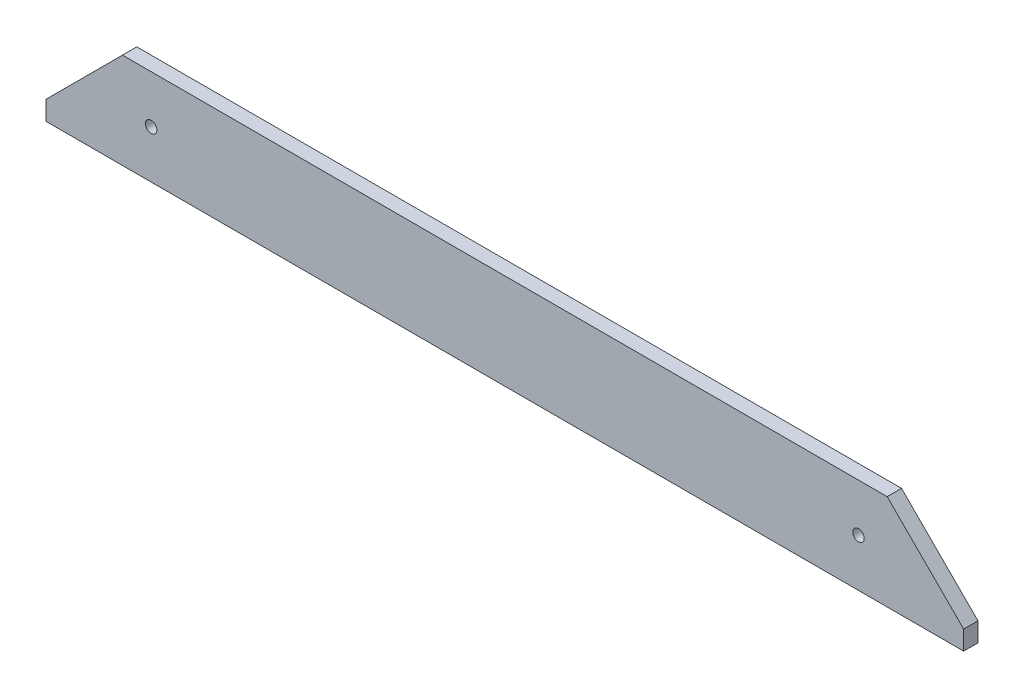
from build123d import *

# Parameters (mm, degrees)
SKETCH1_W          = 609.6
SKETCH1_H          = 63.5
EXTRUDE1_DEPTH     = 4.7625
SKETCH2_R          = 3.81
CUT_EXTRUDE1_DEPTH = 307.597175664
CHAMFER1_SIZE      = 50.8
CHAMFER2_SIZE      = 50.8


with BuildPart() as part:
    # Sketch1 → Extrude1 (new, symmetric)
    with BuildSketch(Plane.XY):
        Rectangle(SKETCH1_W, SKETCH1_H)
    extrude(amount=EXTRUDE1_DEPTH, both=True)

    # Sketch2 → Cut-Extrude1 (cut, through all)
    with BuildSketch(Plane.XY.offset(4.7625)):
        with Locations((-234.95, 0)):
            Circle(SKETCH2_R)
        with Locations((234.95, 0)):
            Circle(SKETCH2_R)
    extrude(amount=-CUT_EXTRUDE1_DEPTH, mode=Mode.SUBTRACT)

    # Chamfer1
    chamfer1_edges = [part.edges().sort_by_distance(p)[0] for p in [
        (304.8, 31.75, 0),
    ]]
    chamfer(chamfer1_edges, length=CHAMFER1_SIZE)

    # Chamfer2
    chamfer2_edges = [part.edges().sort_by_distance(p)[0] for p in [
        (-304.8, 31.75, 0),
    ]]
    chamfer(chamfer2_edges, length=CHAMFER2_SIZE)


solid = part.part
